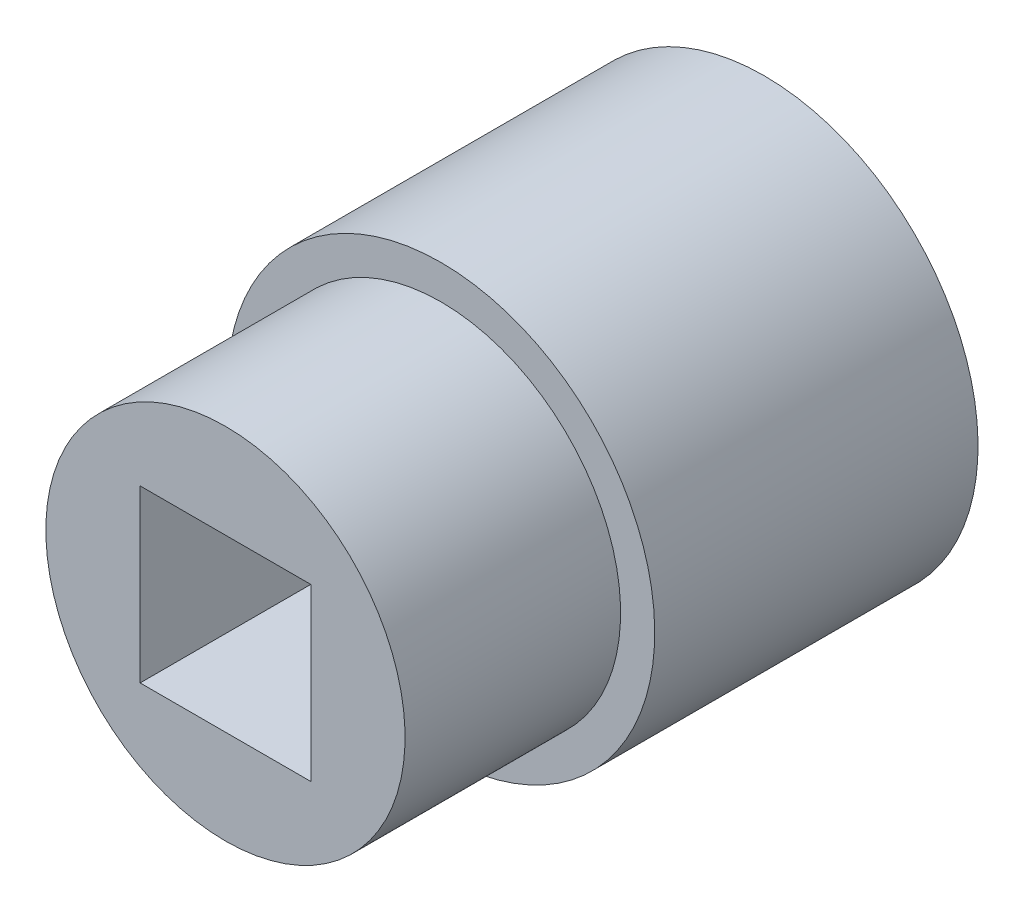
ISO-10303-21;
HEADER;
FILE_DESCRIPTION(('STEP AP214'),'2;1');
FILE_NAME('part.step','',(''),(''),'','','');
FILE_SCHEMA(('AUTOMOTIVE_DESIGN { 1 0 10303 214 1 1 1 1 }'));
ENDSEC;
DATA;
#1=APPLICATION_CONTEXT('core data for automotive mechanical design processes');
#2=APPLICATION_PROTOCOL_DEFINITION('international standard','automotive_design',2000,#1);
#3=PRODUCT_CONTEXT('',#1,'mechanical');
#4=PRODUCT('Part','Part','',(#3));
#5=PRODUCT_RELATED_PRODUCT_CATEGORY('part','',(#4));
#6=PRODUCT_DEFINITION_FORMATION('','',#4);
#7=PRODUCT_DEFINITION_CONTEXT('part definition',#1,'design');
#8=PRODUCT_DEFINITION('design','',#6,#7);
#9=PRODUCT_DEFINITION_SHAPE('','',#8);
#10=(LENGTH_UNIT() NAMED_UNIT(*) SI_UNIT(.MILLI.,.METRE.));
#11=(NAMED_UNIT(*) PLANE_ANGLE_UNIT() SI_UNIT($,.RADIAN.));
#12=(NAMED_UNIT(*) SI_UNIT($,.STERADIAN.) SOLID_ANGLE_UNIT());
#13=UNCERTAINTY_MEASURE_WITH_UNIT(LENGTH_MEASURE(1.E-05),#10,'distance_accuracy_value','');
#14=(GEOMETRIC_REPRESENTATION_CONTEXT(3) GLOBAL_UNCERTAINTY_ASSIGNED_CONTEXT((#13)) GLOBAL_UNIT_ASSIGNED_CONTEXT((#10,
#11,#12)) REPRESENTATION_CONTEXT('',''));
#15=CARTESIAN_POINT('',(0.,0.,0.));
#16=DIRECTION('',(0.,0.,1.));
#17=DIRECTION('',(1.,0.,0.));
#18=AXIS2_PLACEMENT_3D('',#15,#16,#17);
#19=CARTESIAN_POINT('',(0.,0.,0.));
#20=DIRECTION('',(0.,0.,-1.));
#21=DIRECTION('',(0.,1.,0.));
#22=AXIS2_PLACEMENT_3D('',#19,#20,#21);
#23=PLANE('',#22);
#24=DIRECTION('',(0.866025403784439,-0.5,0.));
#25=VECTOR('',#24,1.);
#26=CARTESIAN_POINT('',(0.,9.81495457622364,0.));
#27=LINE('',#26,#25);
#28=CARTESIAN_POINT('',(0.,9.81495457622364,0.));
#29=VERTEX_POINT('',#28);
#30=CARTESIAN_POINT('',(8.5,4.90747728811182,0.));
#31=VERTEX_POINT('',#30);
#32=EDGE_CURVE('E36',#29,#31,#27,.T.);
#33=ORIENTED_EDGE('',*,*,#32,.F.);
#34=DIRECTION('',(0.866025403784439,0.5,0.));
#35=VECTOR('',#34,1.);
#36=CARTESIAN_POINT('',(-8.5,4.90747728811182,0.));
#37=LINE('',#36,#35);
#38=CARTESIAN_POINT('',(-8.5,4.90747728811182,0.));
#39=VERTEX_POINT('',#38);
#40=EDGE_CURVE('E132',#39,#29,#37,.T.);
#41=ORIENTED_EDGE('',*,*,#40,.F.);
#42=DIRECTION('',(0.,1.,0.));
#43=VECTOR('',#42,1.);
#44=CARTESIAN_POINT('',(-8.5,-4.90747728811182,0.));
#45=LINE('',#44,#43);
#46=CARTESIAN_POINT('',(-8.5,-4.90747728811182,0.));
#47=VERTEX_POINT('',#46);
#48=EDGE_CURVE('E158',#47,#39,#45,.T.);
#49=ORIENTED_EDGE('',*,*,#48,.F.);
#50=DIRECTION('',(-0.866025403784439,0.5,0.));
#51=VECTOR('',#50,1.);
#52=CARTESIAN_POINT('',(0.,-9.81495457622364,0.));
#53=LINE('',#52,#51);
#54=CARTESIAN_POINT('',(0.,-9.81495457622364,0.));
#55=VERTEX_POINT('',#54);
#56=EDGE_CURVE('E155',#55,#47,#53,.T.);
#57=ORIENTED_EDGE('',*,*,#56,.F.);
#58=DIRECTION('',(-0.866025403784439,-0.5,0.));
#59=VECTOR('',#58,1.);
#60=CARTESIAN_POINT('',(8.5,-4.90747728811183,0.));
#61=LINE('',#60,#59);
#62=CARTESIAN_POINT('',(8.5,-4.90747728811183,0.));
#63=VERTEX_POINT('',#62);
#64=EDGE_CURVE('E152',#63,#55,#61,.T.);
#65=ORIENTED_EDGE('',*,*,#64,.F.);
#66=DIRECTION('',(0.,-1.,0.));
#67=VECTOR('',#66,1.);
#68=CARTESIAN_POINT('',(8.5,4.90747728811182,0.));
#69=LINE('',#68,#67);
#70=EDGE_CURVE('E149',#31,#63,#69,.T.);
#71=ORIENTED_EDGE('',*,*,#70,.F.);
#72=EDGE_LOOP('',(#33,#41,#49,#57,#65,#71));
#73=FACE_BOUND('',#72,.T.);
#74=CARTESIAN_POINT('',(0.,0.,0.));
#75=DIRECTION('',(0.,0.,-1.));
#76=DIRECTION('',(0.,1.,0.));
#77=AXIS2_PLACEMENT_3D('',#74,#75,#76);
#78=CIRCLE('',#77,11.9);
#79=CARTESIAN_POINT('',(0.,11.9,0.));
#80=VERTEX_POINT('',#79);
#81=EDGE_CURVE('E9',#80,#80,#78,.T.);
#82=ORIENTED_EDGE('',*,*,#81,.T.);
#83=EDGE_LOOP('',(#82));
#84=FACE_BOUND('',#83,.T.);
#85=ADVANCED_FACE('F14',(#73,#84),#23,.T.);
#86=CARTESIAN_POINT('',(0.,0.,0.));
#87=DIRECTION('',(0.,0.,-1.));
#88=DIRECTION('',(0.,1.,0.));
#89=AXIS2_PLACEMENT_3D('',#86,#87,#88);
#90=CYLINDRICAL_SURFACE('',#89,11.9);
#91=CARTESIAN_POINT('',(0.,0.,18.));
#92=DIRECTION('',(0.,0.,-1.));
#93=DIRECTION('',(0.,1.,0.));
#94=AXIS2_PLACEMENT_3D('',#91,#92,#93);
#95=CIRCLE('',#94,11.9);
#96=CARTESIAN_POINT('',(0.,11.9,18.));
#97=VERTEX_POINT('',#96);
#98=EDGE_CURVE('E21',#97,#97,#95,.T.);
#99=ORIENTED_EDGE('',*,*,#98,.T.);
#100=EDGE_LOOP('',(#99));
#101=FACE_BOUND('',#100,.T.);
#102=ORIENTED_EDGE('',*,*,#81,.F.);
#103=EDGE_LOOP('',(#102));
#104=FACE_BOUND('',#103,.T.);
#105=ADVANCED_FACE('F182',(#101,#104),#90,.T.);
#106=CARTESIAN_POINT('',(11.9,0.,18.));
#107=DIRECTION('',(0.,0.,1.));
#108=DIRECTION('',(0.,-1.,0.));
#109=AXIS2_PLACEMENT_3D('',#106,#107,#108);
#110=PLANE('',#109);
#111=CARTESIAN_POINT('',(0.,0.,18.));
#112=DIRECTION('',(0.,0.,-1.));
#113=DIRECTION('',(0.,1.,0.));
#114=AXIS2_PLACEMENT_3D('',#111,#112,#113);
#115=CIRCLE('',#114,10.);
#116=CARTESIAN_POINT('',(0.,10.,18.));
#117=VERTEX_POINT('',#116);
#118=EDGE_CURVE('E177',#117,#117,#115,.T.);
#119=ORIENTED_EDGE('',*,*,#118,.T.);
#120=EDGE_LOOP('',(#119));
#121=FACE_BOUND('',#120,.T.);
#122=ORIENTED_EDGE('',*,*,#98,.F.);
#123=EDGE_LOOP('',(#122));
#124=FACE_BOUND('',#123,.T.);
#125=ADVANCED_FACE('F185',(#121,#124),#110,.T.);
#126=CARTESIAN_POINT('',(0.,0.,0.));
#127=DIRECTION('',(0.,0.,-1.));
#128=DIRECTION('',(0.,1.,0.));
#129=AXIS2_PLACEMENT_3D('',#126,#127,#128);
#130=CYLINDRICAL_SURFACE('',#129,10.);
#131=CARTESIAN_POINT('',(0.,0.,30.));
#132=DIRECTION('',(0.,0.,-1.));
#133=DIRECTION('',(0.,1.,0.));
#134=AXIS2_PLACEMENT_3D('',#131,#132,#133);
#135=CIRCLE('',#134,10.);
#136=CARTESIAN_POINT('',(0.,10.,30.));
#137=VERTEX_POINT('',#136);
#138=EDGE_CURVE('E165',#137,#137,#135,.T.);
#139=ORIENTED_EDGE('',*,*,#138,.T.);
#140=EDGE_LOOP('',(#139));
#141=FACE_BOUND('',#140,.T.);
#142=ORIENTED_EDGE('',*,*,#118,.F.);
#143=EDGE_LOOP('',(#142));
#144=FACE_BOUND('',#143,.T.);
#145=ADVANCED_FACE('F187',(#141,#144),#130,.T.);
#146=CARTESIAN_POINT('',(10.,0.,30.));
#147=DIRECTION('',(0.,0.,1.));
#148=DIRECTION('',(0.,-1.,0.));
#149=AXIS2_PLACEMENT_3D('',#146,#147,#148);
#150=PLANE('',#149);
#151=DIRECTION('',(0.,1.,0.));
#152=VECTOR('',#151,1.);
#153=CARTESIAN_POINT('',(4.75,4.75,30.));
#154=LINE('',#153,#152);
#155=CARTESIAN_POINT('',(4.75,-4.75,30.));
#156=VERTEX_POINT('',#155);
#157=CARTESIAN_POINT('',(4.75,4.75,30.));
#158=VERTEX_POINT('',#157);
#159=EDGE_CURVE('E28',#156,#158,#154,.T.);
#160=ORIENTED_EDGE('',*,*,#159,.F.);
#161=DIRECTION('',(1.,0.,0.));
#162=VECTOR('',#161,1.);
#163=CARTESIAN_POINT('',(-4.75,-4.75,30.));
#164=LINE('',#163,#162);
#165=CARTESIAN_POINT('',(-4.75,-4.75,30.));
#166=VERTEX_POINT('',#165);
#167=EDGE_CURVE('E110',#166,#156,#164,.T.);
#168=ORIENTED_EDGE('',*,*,#167,.F.);
#169=DIRECTION('',(0.,-1.,0.));
#170=VECTOR('',#169,1.);
#171=CARTESIAN_POINT('',(-4.75,4.75,30.));
#172=LINE('',#171,#170);
#173=CARTESIAN_POINT('',(-4.75,4.75,30.));
#174=VERTEX_POINT('',#173);
#175=EDGE_CURVE('E113',#174,#166,#172,.T.);
#176=ORIENTED_EDGE('',*,*,#175,.F.);
#177=DIRECTION('',(-1.,0.,0.));
#178=VECTOR('',#177,1.);
#179=CARTESIAN_POINT('',(-4.75,4.75,30.));
#180=LINE('',#179,#178);
#181=EDGE_CURVE('E119',#158,#174,#180,.T.);
#182=ORIENTED_EDGE('',*,*,#181,.F.);
#183=EDGE_LOOP('',(#160,#168,#176,#182));
#184=FACE_BOUND('',#183,.T.);
#185=ORIENTED_EDGE('',*,*,#138,.F.);
#186=EDGE_LOOP('',(#185));
#187=FACE_BOUND('',#186,.T.);
#188=ADVANCED_FACE('F195',(#184,#187),#150,.T.);
#189=CARTESIAN_POINT('',(0.,9.81495457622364,11.));
#190=DIRECTION('',(0.5,0.866025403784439,0.));
#191=DIRECTION('',(-0.866025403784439,0.5,0.));
#192=AXIS2_PLACEMENT_3D('',#189,#190,#191);
#193=PLANE('',#192);
#194=ORIENTED_EDGE('',*,*,#32,.T.);
#195=DIRECTION('',(0.,0.,-1.));
#196=VECTOR('',#195,1.);
#197=CARTESIAN_POINT('',(8.5,4.90747728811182,11.));
#198=LINE('',#197,#196);
#199=CARTESIAN_POINT('',(8.5,4.90747728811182,11.));
#200=VERTEX_POINT('',#199);
#201=EDGE_CURVE('E147',#200,#31,#198,.T.);
#202=ORIENTED_EDGE('',*,*,#201,.F.);
#203=DIRECTION('',(0.866025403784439,-0.5,0.));
#204=VECTOR('',#203,1.);
#205=CARTESIAN_POINT('',(0.,9.81495457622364,11.));
#206=LINE('',#205,#204);
#207=CARTESIAN_POINT('',(0.,9.81495457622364,11.));
#208=VERTEX_POINT('',#207);
#209=EDGE_CURVE('E128',#208,#200,#206,.T.);
#210=ORIENTED_EDGE('',*,*,#209,.F.);
#211=DIRECTION('',(0.,0.,-1.));
#212=VECTOR('',#211,1.);
#213=CARTESIAN_POINT('',(0.,9.81495457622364,11.));
#214=LINE('',#213,#212);
#215=EDGE_CURVE('E163',#208,#29,#214,.T.);
#216=ORIENTED_EDGE('',*,*,#215,.T.);
#217=EDGE_LOOP('',(#194,#202,#210,#216));
#218=FACE_BOUND('',#217,.T.);
#219=ADVANCED_FACE('F214',(#218),#193,.F.);
#220=CARTESIAN_POINT('',(-8.5,4.90747728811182,11.));
#221=DIRECTION('',(-0.5,0.866025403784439,0.));
#222=DIRECTION('',(-0.866025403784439,-0.5,0.));
#223=AXIS2_PLACEMENT_3D('',#220,#221,#222);
#224=PLANE('',#223);
#225=ORIENTED_EDGE('',*,*,#40,.T.);
#226=ORIENTED_EDGE('',*,*,#215,.F.);
#227=DIRECTION('',(0.866025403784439,0.5,0.));
#228=VECTOR('',#227,1.);
#229=CARTESIAN_POINT('',(-8.5,4.90747728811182,11.));
#230=LINE('',#229,#228);
#231=CARTESIAN_POINT('',(-8.5,4.90747728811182,11.));
#232=VERTEX_POINT('',#231);
#233=EDGE_CURVE('E144',#232,#208,#230,.T.);
#234=ORIENTED_EDGE('',*,*,#233,.F.);
#235=DIRECTION('',(0.,0.,-1.));
#236=VECTOR('',#235,1.);
#237=CARTESIAN_POINT('',(-8.5,4.90747728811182,11.));
#238=LINE('',#237,#236);
#239=EDGE_CURVE('E166',#232,#39,#238,.T.);
#240=ORIENTED_EDGE('',*,*,#239,.T.);
#241=EDGE_LOOP('',(#225,#226,#234,#240));
#242=FACE_BOUND('',#241,.T.);
#243=ADVANCED_FACE('F220',(#242),#224,.F.);
#244=CARTESIAN_POINT('',(-8.5,-4.90747728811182,11.));
#245=DIRECTION('',(-1.,0.,0.));
#246=DIRECTION('',(0.,-1.,0.));
#247=AXIS2_PLACEMENT_3D('',#244,#245,#246);
#248=PLANE('',#247);
#249=ORIENTED_EDGE('',*,*,#48,.T.);
#250=ORIENTED_EDGE('',*,*,#239,.F.);
#251=DIRECTION('',(0.,1.,0.));
#252=VECTOR('',#251,1.);
#253=CARTESIAN_POINT('',(-8.5,-4.90747728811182,11.));
#254=LINE('',#253,#252);
#255=CARTESIAN_POINT('',(-8.5,-4.90747728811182,11.));
#256=VERTEX_POINT('',#255);
#257=EDGE_CURVE('E141',#256,#232,#254,.T.);
#258=ORIENTED_EDGE('',*,*,#257,.F.);
#259=DIRECTION('',(0.,0.,-1.));
#260=VECTOR('',#259,1.);
#261=CARTESIAN_POINT('',(-8.5,-4.90747728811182,11.));
#262=LINE('',#261,#260);
#263=EDGE_CURVE('E168',#256,#47,#262,.T.);
#264=ORIENTED_EDGE('',*,*,#263,.T.);
#265=EDGE_LOOP('',(#249,#250,#258,#264));
#266=FACE_BOUND('',#265,.T.);
#267=ADVANCED_FACE('F222',(#266),#248,.F.);
#268=CARTESIAN_POINT('',(0.,-9.81495457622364,11.));
#269=DIRECTION('',(-0.5,-0.866025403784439,0.));
#270=DIRECTION('',(0.866025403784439,-0.5,0.));
#271=AXIS2_PLACEMENT_3D('',#268,#269,#270);
#272=PLANE('',#271);
#273=ORIENTED_EDGE('',*,*,#56,.T.);
#274=ORIENTED_EDGE('',*,*,#263,.F.);
#275=DIRECTION('',(-0.866025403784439,0.5,0.));
#276=VECTOR('',#275,1.);
#277=CARTESIAN_POINT('',(0.,-9.81495457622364,11.));
#278=LINE('',#277,#276);
#279=CARTESIAN_POINT('',(0.,-9.81495457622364,11.));
#280=VERTEX_POINT('',#279);
#281=EDGE_CURVE('E138',#280,#256,#278,.T.);
#282=ORIENTED_EDGE('',*,*,#281,.F.);
#283=DIRECTION('',(0.,0.,-1.));
#284=VECTOR('',#283,1.);
#285=CARTESIAN_POINT('',(0.,-9.81495457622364,11.));
#286=LINE('',#285,#284);
#287=EDGE_CURVE('E170',#280,#55,#286,.T.);
#288=ORIENTED_EDGE('',*,*,#287,.T.);
#289=EDGE_LOOP('',(#273,#274,#282,#288));
#290=FACE_BOUND('',#289,.T.);
#291=ADVANCED_FACE('F224',(#290),#272,.F.);
#292=CARTESIAN_POINT('',(8.5,-4.90747728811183,11.));
#293=DIRECTION('',(0.5,-0.866025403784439,0.));
#294=DIRECTION('',(0.866025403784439,0.5,0.));
#295=AXIS2_PLACEMENT_3D('',#292,#293,#294);
#296=PLANE('',#295);
#297=ORIENTED_EDGE('',*,*,#64,.T.);
#298=ORIENTED_EDGE('',*,*,#287,.F.);
#299=DIRECTION('',(-0.866025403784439,-0.5,0.));
#300=VECTOR('',#299,1.);
#301=CARTESIAN_POINT('',(8.5,-4.90747728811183,11.));
#302=LINE('',#301,#300);
#303=CARTESIAN_POINT('',(8.5,-4.90747728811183,11.));
#304=VERTEX_POINT('',#303);
#305=EDGE_CURVE('E135',#304,#280,#302,.T.);
#306=ORIENTED_EDGE('',*,*,#305,.F.);
#307=DIRECTION('',(0.,0.,-1.));
#308=VECTOR('',#307,1.);
#309=CARTESIAN_POINT('',(8.5,-4.90747728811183,11.));
#310=LINE('',#309,#308);
#311=EDGE_CURVE('E172',#304,#63,#310,.T.);
#312=ORIENTED_EDGE('',*,*,#311,.T.);
#313=EDGE_LOOP('',(#297,#298,#306,#312));
#314=FACE_BOUND('',#313,.T.);
#315=ADVANCED_FACE('F227',(#314),#296,.F.);
#316=CARTESIAN_POINT('',(8.5,4.90747728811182,11.));
#317=DIRECTION('',(1.,0.,0.));
#318=DIRECTION('',(0.,1.,0.));
#319=AXIS2_PLACEMENT_3D('',#316,#317,#318);
#320=PLANE('',#319);
#321=ORIENTED_EDGE('',*,*,#70,.T.);
#322=ORIENTED_EDGE('',*,*,#311,.F.);
#323=DIRECTION('',(0.,-1.,0.));
#324=VECTOR('',#323,1.);
#325=CARTESIAN_POINT('',(8.5,4.90747728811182,11.));
#326=LINE('',#325,#324);
#327=EDGE_CURVE('E131',#200,#304,#326,.T.);
#328=ORIENTED_EDGE('',*,*,#327,.F.);
#329=ORIENTED_EDGE('',*,*,#201,.T.);
#330=EDGE_LOOP('',(#321,#322,#328,#329));
#331=FACE_BOUND('',#330,.T.);
#332=ADVANCED_FACE('F210',(#331),#320,.F.);
#333=CARTESIAN_POINT('',(8.5,4.90747728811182,11.));
#334=DIRECTION('',(0.,0.,-1.));
#335=DIRECTION('',(0.,1.,0.));
#336=AXIS2_PLACEMENT_3D('',#333,#334,#335);
#337=PLANE('',#336);
#338=ORIENTED_EDGE('',*,*,#209,.T.);
#339=ORIENTED_EDGE('',*,*,#327,.T.);
#340=ORIENTED_EDGE('',*,*,#305,.T.);
#341=ORIENTED_EDGE('',*,*,#281,.T.);
#342=ORIENTED_EDGE('',*,*,#257,.T.);
#343=ORIENTED_EDGE('',*,*,#233,.T.);
#344=EDGE_LOOP('',(#338,#339,#340,#341,#342,#343));
#345=FACE_BOUND('',#344,.T.);
#346=ADVANCED_FACE('F217',(#345),#337,.T.);
#347=CARTESIAN_POINT('',(4.75,4.75,18.));
#348=DIRECTION('',(1.,0.,0.));
#349=DIRECTION('',(0.,1.,0.));
#350=AXIS2_PLACEMENT_3D('',#347,#348,#349);
#351=PLANE('',#350);
#352=ORIENTED_EDGE('',*,*,#159,.T.);
#353=DIRECTION('',(0.,0.,1.));
#354=VECTOR('',#353,1.);
#355=CARTESIAN_POINT('',(4.75,4.75,18.));
#356=LINE('',#355,#354);
#357=CARTESIAN_POINT('',(4.75,4.75,18.));
#358=VERTEX_POINT('',#357);
#359=EDGE_CURVE('E88',#358,#158,#356,.T.);
#360=ORIENTED_EDGE('',*,*,#359,.F.);
#361=DIRECTION('',(0.,1.,0.));
#362=VECTOR('',#361,1.);
#363=CARTESIAN_POINT('',(4.75,4.75,18.));
#364=LINE('',#363,#362);
#365=CARTESIAN_POINT('',(4.75,-4.75,18.));
#366=VERTEX_POINT('',#365);
#367=EDGE_CURVE('E92',#366,#358,#364,.T.);
#368=ORIENTED_EDGE('',*,*,#367,.F.);
#369=DIRECTION('',(0.,0.,1.));
#370=VECTOR('',#369,1.);
#371=CARTESIAN_POINT('',(4.75,-4.75,18.));
#372=LINE('',#371,#370);
#373=EDGE_CURVE('E123',#366,#156,#372,.T.);
#374=ORIENTED_EDGE('',*,*,#373,.T.);
#375=EDGE_LOOP('',(#352,#360,#368,#374));
#376=FACE_BOUND('',#375,.T.);
#377=ADVANCED_FACE('F90',(#376),#351,.F.);
#378=CARTESIAN_POINT('',(-4.75,-4.75,18.));
#379=DIRECTION('',(0.,-1.,0.));
#380=DIRECTION('',(1.,0.,0.));
#381=AXIS2_PLACEMENT_3D('',#378,#379,#380);
#382=PLANE('',#381);
#383=ORIENTED_EDGE('',*,*,#167,.T.);
#384=ORIENTED_EDGE('',*,*,#373,.F.);
#385=DIRECTION('',(1.,0.,0.));
#386=VECTOR('',#385,1.);
#387=CARTESIAN_POINT('',(-4.75,-4.75,18.));
#388=LINE('',#387,#386);
#389=CARTESIAN_POINT('',(-4.75,-4.75,18.));
#390=VERTEX_POINT('',#389);
#391=EDGE_CURVE('E98',#390,#366,#388,.T.);
#392=ORIENTED_EDGE('',*,*,#391,.F.);
#393=DIRECTION('',(0.,0.,1.));
#394=VECTOR('',#393,1.);
#395=CARTESIAN_POINT('',(-4.75,-4.75,18.));
#396=LINE('',#395,#394);
#397=EDGE_CURVE('E125',#390,#166,#396,.T.);
#398=ORIENTED_EDGE('',*,*,#397,.T.);
#399=EDGE_LOOP('',(#383,#384,#392,#398));
#400=FACE_BOUND('',#399,.T.);
#401=ADVANCED_FACE('F253',(#400),#382,.F.);
#402=CARTESIAN_POINT('',(-4.75,4.75,18.));
#403=DIRECTION('',(-1.,0.,0.));
#404=DIRECTION('',(0.,-1.,0.));
#405=AXIS2_PLACEMENT_3D('',#402,#403,#404);
#406=PLANE('',#405);
#407=ORIENTED_EDGE('',*,*,#175,.T.);
#408=ORIENTED_EDGE('',*,*,#397,.F.);
#409=DIRECTION('',(0.,-1.,0.));
#410=VECTOR('',#409,1.);
#411=CARTESIAN_POINT('',(-4.75,4.75,18.));
#412=LINE('',#411,#410);
#413=CARTESIAN_POINT('',(-4.75,4.75,18.));
#414=VERTEX_POINT('',#413);
#415=EDGE_CURVE('E106',#414,#390,#412,.T.);
#416=ORIENTED_EDGE('',*,*,#415,.F.);
#417=DIRECTION('',(0.,0.,1.));
#418=VECTOR('',#417,1.);
#419=CARTESIAN_POINT('',(-4.75,4.75,18.));
#420=LINE('',#419,#418);
#421=EDGE_CURVE('E97',#414,#174,#420,.T.);
#422=ORIENTED_EDGE('',*,*,#421,.T.);
#423=EDGE_LOOP('',(#407,#408,#416,#422));
#424=FACE_BOUND('',#423,.T.);
#425=ADVANCED_FACE('F251',(#424),#406,.F.);
#426=CARTESIAN_POINT('',(-4.75,4.75,18.));
#427=DIRECTION('',(0.,1.,0.));
#428=DIRECTION('',(-1.,0.,0.));
#429=AXIS2_PLACEMENT_3D('',#426,#427,#428);
#430=PLANE('',#429);
#431=ORIENTED_EDGE('',*,*,#181,.T.);
#432=ORIENTED_EDGE('',*,*,#421,.F.);
#433=DIRECTION('',(-1.,0.,0.));
#434=VECTOR('',#433,1.);
#435=CARTESIAN_POINT('',(-4.75,4.75,18.));
#436=LINE('',#435,#434);
#437=EDGE_CURVE('E101',#358,#414,#436,.T.);
#438=ORIENTED_EDGE('',*,*,#437,.F.);
#439=ORIENTED_EDGE('',*,*,#359,.T.);
#440=EDGE_LOOP('',(#431,#432,#438,#439));
#441=FACE_BOUND('',#440,.T.);
#442=ADVANCED_FACE('F102',(#441),#430,.F.);
#443=CARTESIAN_POINT('',(4.75,-4.75,18.));
#444=DIRECTION('',(0.,0.,1.));
#445=DIRECTION('',(0.,-1.,0.));
#446=AXIS2_PLACEMENT_3D('',#443,#444,#445);
#447=PLANE('',#446);
#448=ORIENTED_EDGE('',*,*,#367,.T.);
#449=ORIENTED_EDGE('',*,*,#437,.T.);
#450=ORIENTED_EDGE('',*,*,#415,.T.);
#451=ORIENTED_EDGE('',*,*,#391,.T.);
#452=EDGE_LOOP('',(#448,#449,#450,#451));
#453=FACE_BOUND('',#452,.T.);
#454=ADVANCED_FACE('F108',(#453),#447,.T.);
#455=CLOSED_SHELL('',(#85,#105,#125,#145,#188,#219,#243,#267,#291,#315,#332,#346,#377,#401,#425,
#442,#454));
#456=MANIFOLD_SOLID_BREP('B1',#455);
#457=ADVANCED_BREP_SHAPE_REPRESENTATION('',(#18,#456),#14);
#458=SHAPE_DEFINITION_REPRESENTATION(#9,#457);
ENDSEC;
END-ISO-10303-21;
